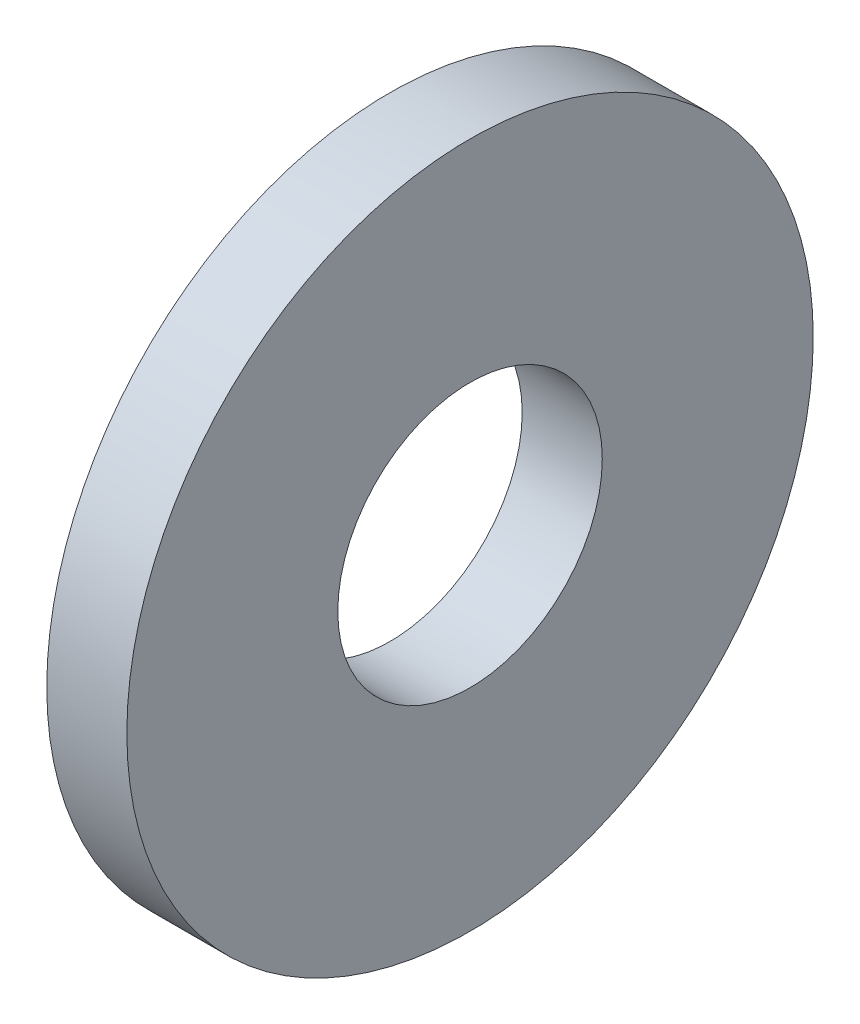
from build123d import *

# Parameters (mm, degrees)
SKETCH1_W = 1.75
SKETCH1_H = 4.61


with BuildPart() as part:
    # Sketch1 → Base-Revolve (revolve)
    with BuildSketch(Plane.XY, mode=Mode.PRIVATE) as base_revolve_sk:
        with Locations((-0.875, 5.195)):
            Rectangle(SKETCH1_W, SKETCH1_H)
    revolve(base_revolve_sk.sketch.rotate(Axis((-34.925, 0, 0), (1, 0, 0)), 90), axis=Axis((-34.925, 0, 0), (1, 0, 0)))


solid = part.part
